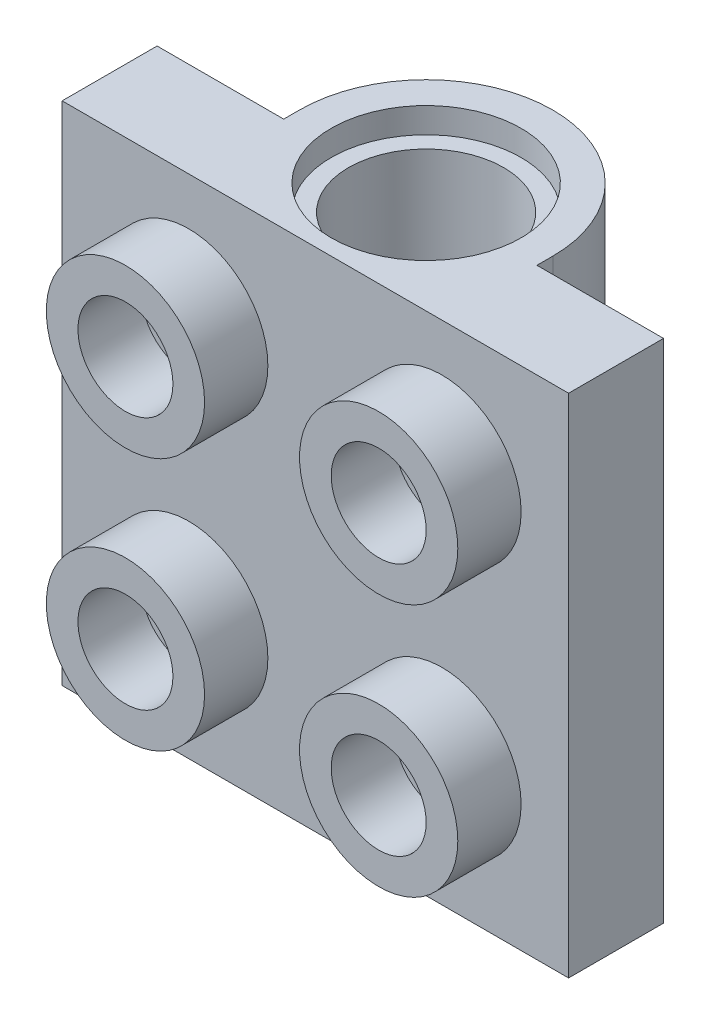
ISO-10303-21;
HEADER;
FILE_DESCRIPTION(('STEP AP214'),'2;1');
FILE_NAME('part.step','',(''),(''),'','','');
FILE_SCHEMA(('AUTOMOTIVE_DESIGN { 1 0 10303 214 1 1 1 1 }'));
ENDSEC;
DATA;
#1=APPLICATION_CONTEXT('core data for automotive mechanical design processes');
#2=APPLICATION_PROTOCOL_DEFINITION('international standard','automotive_design',2000,#1);
#3=PRODUCT_CONTEXT('',#1,'mechanical');
#4=PRODUCT('Part','Part','',(#3));
#5=PRODUCT_RELATED_PRODUCT_CATEGORY('part','',(#4));
#6=PRODUCT_DEFINITION_FORMATION('','',#4);
#7=PRODUCT_DEFINITION_CONTEXT('part definition',#1,'design');
#8=PRODUCT_DEFINITION('design','',#6,#7);
#9=PRODUCT_DEFINITION_SHAPE('','',#8);
#10=(LENGTH_UNIT() NAMED_UNIT(*) SI_UNIT(.MILLI.,.METRE.));
#11=(NAMED_UNIT(*) PLANE_ANGLE_UNIT() SI_UNIT($,.RADIAN.));
#12=(NAMED_UNIT(*) SI_UNIT($,.STERADIAN.) SOLID_ANGLE_UNIT());
#13=UNCERTAINTY_MEASURE_WITH_UNIT(LENGTH_MEASURE(1.E-05),#10,'distance_accuracy_value','');
#14=(GEOMETRIC_REPRESENTATION_CONTEXT(3) GLOBAL_UNCERTAINTY_ASSIGNED_CONTEXT((#13)) GLOBAL_UNIT_ASSIGNED_CONTEXT((#10,
#11,#12)) REPRESENTATION_CONTEXT('',''));
#15=CARTESIAN_POINT('',(0.,0.,0.));
#16=DIRECTION('',(0.,0.,1.));
#17=DIRECTION('',(1.,0.,0.));
#18=AXIS2_PLACEMENT_3D('',#15,#16,#17);
#19=CARTESIAN_POINT('',(-0.577603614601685,7.86828450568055,-3.5));
#20=DIRECTION('',(0.,-1.,0.));
#21=DIRECTION('',(0.,0.,-1.));
#22=AXIS2_PLACEMENT_3D('',#19,#20,#21);
#23=CYLINDRICAL_SURFACE('',#22,2.45);
#24=CARTESIAN_POINT('',(-0.577603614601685,-7.33171549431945,-3.5));
#25=DIRECTION('',(0.,-1.,0.));
#26=DIRECTION('',(0.,0.,-1.));
#27=AXIS2_PLACEMENT_3D('',#24,#25,#26);
#28=CIRCLE('',#27,2.45);
#29=CARTESIAN_POINT('',(-0.577603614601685,-7.33171549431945,-5.95));
#30=VERTEX_POINT('',#29);
#31=EDGE_CURVE('E204',#30,#30,#28,.F.);
#32=ORIENTED_EDGE('',*,*,#31,.F.);
#33=EDGE_LOOP('',(#32));
#34=FACE_BOUND('',#33,.T.);
#35=CARTESIAN_POINT('',(-0.577603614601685,-1.13171549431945,-3.5));
#36=DIRECTION('',(0.,1.,0.));
#37=DIRECTION('',(0.,0.,1.));
#38=AXIS2_PLACEMENT_3D('',#35,#36,#37);
#39=CIRCLE('',#38,2.45);
#40=CARTESIAN_POINT('',(-0.577603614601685,-1.13171549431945,-1.05));
#41=VERTEX_POINT('',#40);
#42=EDGE_CURVE('E235',#41,#41,#39,.F.);
#43=ORIENTED_EDGE('',*,*,#42,.F.);
#44=EDGE_LOOP('',(#43));
#45=FACE_BOUND('',#44,.T.);
#46=ADVANCED_FACE('F35',(#34,#45),#23,.F.);
#47=CARTESIAN_POINT('',(-0.577603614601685,7.06828450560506,-3.5));
#48=DIRECTION('',(0.,1.,0.));
#49=DIRECTION('',(0.,0.,1.));
#50=AXIS2_PLACEMENT_3D('',#47,#48,#49);
#51=CIRCLE('',#50,2.45);
#52=CARTESIAN_POINT('',(-0.577603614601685,7.06828450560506,-1.05));
#53=VERTEX_POINT('',#52);
#54=EDGE_CURVE('E209',#53,#53,#51,.F.);
#55=ORIENTED_EDGE('',*,*,#54,.F.);
#56=EDGE_LOOP('',(#55));
#57=FACE_BOUND('',#56,.T.);
#58=CARTESIAN_POINT('',(-0.577603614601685,0.86828450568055,-3.5));
#59=DIRECTION('',(0.,-1.,0.));
#60=DIRECTION('',(0.,0.,-1.));
#61=AXIS2_PLACEMENT_3D('',#58,#59,#60);
#62=CIRCLE('',#61,2.45);
#63=CARTESIAN_POINT('',(-0.577603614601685,0.86828450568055,-5.95));
#64=VERTEX_POINT('',#63);
#65=EDGE_CURVE('E188',#64,#64,#62,.F.);
#66=ORIENTED_EDGE('',*,*,#65,.F.);
#67=EDGE_LOOP('',(#66));
#68=FACE_BOUND('',#67,.T.);
#69=ADVANCED_FACE('F436',(#57,#68),#23,.F.);
#70=CARTESIAN_POINT('',(-4.57760361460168,7.86828450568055,-3.5));
#71=DIRECTION('',(-1.,0.,0.));
#72=DIRECTION('',(0.,0.,1.));
#73=AXIS2_PLACEMENT_3D('',#70,#71,#72);
#74=PLANE('',#73);
#75=DIRECTION('',(0.,1.,0.));
#76=VECTOR('',#75,1.);
#77=CARTESIAN_POINT('',(-4.57760361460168,6.36828450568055,-1.));
#78=LINE('',#77,#76);
#79=CARTESIAN_POINT('',(-4.57760361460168,-6.63171549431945,-1.));
#80=VERTEX_POINT('',#79);
#81=CARTESIAN_POINT('',(-4.57760361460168,-1.13171549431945,-1.));
#82=VERTEX_POINT('',#81);
#83=EDGE_CURVE('E196',#80,#82,#78,.T.);
#84=ORIENTED_EDGE('',*,*,#83,.T.);
#85=DIRECTION('',(0.,0.,-1.));
#86=VECTOR('',#85,1.);
#87=CARTESIAN_POINT('',(-4.57760361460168,-1.13171549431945,-3.5));
#88=LINE('',#87,#86);
#89=CARTESIAN_POINT('',(-4.57760361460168,-1.13171549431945,-3.5));
#90=VERTEX_POINT('',#89);
#91=EDGE_CURVE('E232',#82,#90,#88,.T.);
#92=ORIENTED_EDGE('',*,*,#91,.T.);
#93=DIRECTION('',(0.,-1.,0.));
#94=VECTOR('',#93,1.);
#95=CARTESIAN_POINT('',(-4.57760361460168,7.86828450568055,-3.5));
#96=LINE('',#95,#94);
#97=CARTESIAN_POINT('',(-4.57760361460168,-8.13171549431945,-3.5));
#98=VERTEX_POINT('',#97);
#99=EDGE_CURVE('E264',#90,#98,#96,.T.);
#100=ORIENTED_EDGE('',*,*,#99,.T.);
#101=DIRECTION('',(0.,0.,-1.));
#102=VECTOR('',#101,1.);
#103=CARTESIAN_POINT('',(-4.57760361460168,-8.13171549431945,-3.5));
#104=LINE('',#103,#102);
#105=CARTESIAN_POINT('',(-4.57760361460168,-8.13171549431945,-3.));
#106=VERTEX_POINT('',#105);
#107=EDGE_CURVE('E250',#106,#98,#104,.T.);
#108=ORIENTED_EDGE('',*,*,#107,.F.);
#109=DIRECTION('',(0.,-1.,0.));
#110=VECTOR('',#109,1.);
#111=CARTESIAN_POINT('',(-4.57760361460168,-8.13171549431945,-3.));
#112=LINE('',#111,#110);
#113=CARTESIAN_POINT('',(-4.57760361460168,-6.63171549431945,-3.));
#114=VERTEX_POINT('',#113);
#115=EDGE_CURVE('E277',#114,#106,#112,.T.);
#116=ORIENTED_EDGE('',*,*,#115,.F.);
#117=DIRECTION('',(0.,0.,-1.));
#118=VECTOR('',#117,1.);
#119=CARTESIAN_POINT('',(-4.57760361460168,-6.63171549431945,-1.));
#120=LINE('',#119,#118);
#121=EDGE_CURVE('E275',#80,#114,#120,.T.);
#122=ORIENTED_EDGE('',*,*,#121,.F.);
#123=EDGE_LOOP('',(#84,#92,#100,#108,#116,#122));
#124=FACE_BOUND('',#123,.T.);
#125=ADVANCED_FACE('F398',(#124),#74,.T.);
#126=CARTESIAN_POINT('',(-4.57760361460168,7.86828450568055,-3.5));
#127=VERTEX_POINT('',#126);
#128=CARTESIAN_POINT('',(-4.57760361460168,0.86828450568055,-3.5));
#129=VERTEX_POINT('',#128);
#130=EDGE_CURVE('E187',#127,#129,#96,.T.);
#131=ORIENTED_EDGE('',*,*,#130,.T.);
#132=DIRECTION('',(0.,0.,1.));
#133=VECTOR('',#132,1.);
#134=CARTESIAN_POINT('',(-4.57760361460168,0.86828450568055,-3.5));
#135=LINE('',#134,#133);
#136=CARTESIAN_POINT('',(-4.57760361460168,0.86828450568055,-1.));
#137=VERTEX_POINT('',#136);
#138=EDGE_CURVE('E50',#129,#137,#135,.T.);
#139=ORIENTED_EDGE('',*,*,#138,.T.);
#140=CARTESIAN_POINT('',(-4.57760361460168,6.36828450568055,-1.));
#141=VERTEX_POINT('',#140);
#142=EDGE_CURVE('E184',#137,#141,#78,.T.);
#143=ORIENTED_EDGE('',*,*,#142,.T.);
#144=DIRECTION('',(0.,0.,1.));
#145=VECTOR('',#144,1.);
#146=CARTESIAN_POINT('',(-4.57760361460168,6.36828450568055,-1.));
#147=LINE('',#146,#145);
#148=CARTESIAN_POINT('',(-4.57760361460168,6.36828450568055,-3.));
#149=VERTEX_POINT('',#148);
#150=EDGE_CURVE('E273',#149,#141,#147,.T.);
#151=ORIENTED_EDGE('',*,*,#150,.F.);
#152=CARTESIAN_POINT('',(-4.57760361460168,7.86828450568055,-3.));
#153=VERTEX_POINT('',#152);
#154=EDGE_CURVE('E279',#153,#149,#112,.T.);
#155=ORIENTED_EDGE('',*,*,#154,.F.);
#156=DIRECTION('',(0.,0.,-1.));
#157=VECTOR('',#156,1.);
#158=CARTESIAN_POINT('',(-4.57760361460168,7.86828450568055,-3.5));
#159=LINE('',#158,#157);
#160=EDGE_CURVE('E252',#153,#127,#159,.T.);
#161=ORIENTED_EDGE('',*,*,#160,.T.);
#162=EDGE_LOOP('',(#131,#139,#143,#151,#155,#161));
#163=FACE_BOUND('',#162,.T.);
#164=ADVANCED_FACE('F182',(#163),#74,.T.);
#165=CARTESIAN_POINT('',(3.42239638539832,7.86828450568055,-3.5));
#166=DIRECTION('',(1.,0.,0.));
#167=DIRECTION('',(0.,0.,-1.));
#168=AXIS2_PLACEMENT_3D('',#165,#166,#167);
#169=PLANE('',#168);
#170=DIRECTION('',(0.,-1.,0.));
#171=VECTOR('',#170,1.);
#172=CARTESIAN_POINT('',(3.42239638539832,7.86828450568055,-3.5));
#173=LINE('',#172,#171);
#174=CARTESIAN_POINT('',(3.42239638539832,-1.13171549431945,-3.5));
#175=VERTEX_POINT('',#174);
#176=CARTESIAN_POINT('',(3.42239638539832,-8.13171549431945,-3.5));
#177=VERTEX_POINT('',#176);
#178=EDGE_CURVE('E254',#175,#177,#173,.T.);
#179=ORIENTED_EDGE('',*,*,#178,.F.);
#180=DIRECTION('',(0.,0.,1.));
#181=VECTOR('',#180,1.);
#182=CARTESIAN_POINT('',(3.42239638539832,-1.13171549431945,-3.5));
#183=LINE('',#182,#181);
#184=CARTESIAN_POINT('',(3.42239638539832,-1.13171549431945,-1.));
#185=VERTEX_POINT('',#184);
#186=EDGE_CURVE('E229',#175,#185,#183,.T.);
#187=ORIENTED_EDGE('',*,*,#186,.T.);
#188=DIRECTION('',(0.,-1.,0.));
#189=VECTOR('',#188,1.);
#190=CARTESIAN_POINT('',(3.42239638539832,6.36828450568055,-1.));
#191=LINE('',#190,#189);
#192=CARTESIAN_POINT('',(3.42239638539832,-6.63171549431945,-1.));
#193=VERTEX_POINT('',#192);
#194=EDGE_CURVE('E200',#185,#193,#191,.T.);
#195=ORIENTED_EDGE('',*,*,#194,.T.);
#196=DIRECTION('',(0.,0.,1.));
#197=VECTOR('',#196,1.);
#198=CARTESIAN_POINT('',(3.42239638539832,-6.63171549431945,-1.));
#199=LINE('',#198,#197);
#200=CARTESIAN_POINT('',(3.42239638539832,-6.63171549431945,-3.));
#201=VERTEX_POINT('',#200);
#202=EDGE_CURVE('E267',#201,#193,#199,.T.);
#203=ORIENTED_EDGE('',*,*,#202,.F.);
#204=DIRECTION('',(0.,1.,0.));
#205=VECTOR('',#204,1.);
#206=CARTESIAN_POINT('',(3.42239638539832,-8.13171549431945,-3.));
#207=LINE('',#206,#205);
#208=CARTESIAN_POINT('',(3.42239638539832,-8.13171549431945,-3.));
#209=VERTEX_POINT('',#208);
#210=EDGE_CURVE('E272',#209,#201,#207,.T.);
#211=ORIENTED_EDGE('',*,*,#210,.F.);
#212=DIRECTION('',(0.,0.,1.));
#213=VECTOR('',#212,1.);
#214=CARTESIAN_POINT('',(3.42239638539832,-8.13171549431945,-3.5));
#215=LINE('',#214,#213);
#216=EDGE_CURVE('E257',#177,#209,#215,.T.);
#217=ORIENTED_EDGE('',*,*,#216,.F.);
#218=EDGE_LOOP('',(#179,#187,#195,#203,#211,#217));
#219=FACE_BOUND('',#218,.T.);
#220=ADVANCED_FACE('F376',(#219),#169,.T.);
#221=CARTESIAN_POINT('',(3.42239638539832,6.36828450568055,-1.));
#222=VERTEX_POINT('',#221);
#223=CARTESIAN_POINT('',(3.42239638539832,0.86828450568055,-1.));
#224=VERTEX_POINT('',#223);
#225=EDGE_CURVE('E197',#222,#224,#191,.T.);
#226=ORIENTED_EDGE('',*,*,#225,.T.);
#227=DIRECTION('',(0.,0.,-1.));
#228=VECTOR('',#227,1.);
#229=CARTESIAN_POINT('',(3.42239638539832,0.86828450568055,-3.5));
#230=LINE('',#229,#228);
#231=CARTESIAN_POINT('',(3.42239638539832,0.86828450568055,-3.5));
#232=VERTEX_POINT('',#231);
#233=EDGE_CURVE('E174',#224,#232,#230,.T.);
#234=ORIENTED_EDGE('',*,*,#233,.T.);
#235=CARTESIAN_POINT('',(3.42239638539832,7.86828450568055,-3.5));
#236=VERTEX_POINT('',#235);
#237=EDGE_CURVE('E218',#236,#232,#173,.T.);
#238=ORIENTED_EDGE('',*,*,#237,.F.);
#239=DIRECTION('',(0.,0.,1.));
#240=VECTOR('',#239,1.);
#241=CARTESIAN_POINT('',(3.42239638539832,7.86828450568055,-3.5));
#242=LINE('',#241,#240);
#243=CARTESIAN_POINT('',(3.42239638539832,7.86828450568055,-3.));
#244=VERTEX_POINT('',#243);
#245=EDGE_CURVE('E249',#236,#244,#242,.T.);
#246=ORIENTED_EDGE('',*,*,#245,.T.);
#247=CARTESIAN_POINT('',(3.42239638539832,6.36828450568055,-3.));
#248=VERTEX_POINT('',#247);
#249=EDGE_CURVE('E270',#248,#244,#207,.T.);
#250=ORIENTED_EDGE('',*,*,#249,.F.);
#251=DIRECTION('',(0.,0.,-1.));
#252=VECTOR('',#251,1.);
#253=CARTESIAN_POINT('',(3.42239638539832,6.36828450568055,-1.));
#254=LINE('',#253,#252);
#255=EDGE_CURVE('E263',#222,#248,#254,.T.);
#256=ORIENTED_EDGE('',*,*,#255,.F.);
#257=EDGE_LOOP('',(#226,#234,#238,#246,#250,#256));
#258=FACE_BOUND('',#257,.T.);
#259=ADVANCED_FACE('F220',(#258),#169,.T.);
#260=CARTESIAN_POINT('',(-0.577603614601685,7.86828450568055,-3.5));
#261=DIRECTION('',(0.,-1.,0.));
#262=DIRECTION('',(0.,0.,-1.));
#263=AXIS2_PLACEMENT_3D('',#260,#261,#262);
#264=CYLINDRICAL_SURFACE('',#263,4.);
#265=ORIENTED_EDGE('',*,*,#99,.F.);
#266=CARTESIAN_POINT('',(-0.577603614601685,-1.13171549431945,-3.5));
#267=DIRECTION('',(0.,1.,0.));
#268=DIRECTION('',(0.,0.,1.));
#269=AXIS2_PLACEMENT_3D('',#266,#267,#268);
#270=CIRCLE('',#269,4.);
#271=EDGE_CURVE('E11',#90,#175,#270,.F.);
#272=ORIENTED_EDGE('',*,*,#271,.T.);
#273=ORIENTED_EDGE('',*,*,#178,.T.);
#274=CARTESIAN_POINT('',(-0.577603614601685,-8.13171549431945,-3.5));
#275=DIRECTION('',(0.,-1.,0.));
#276=DIRECTION('',(0.,0.,-1.));
#277=AXIS2_PLACEMENT_3D('',#274,#275,#276);
#278=CIRCLE('',#277,4.);
#279=EDGE_CURVE('E207',#98,#177,#278,.T.);
#280=ORIENTED_EDGE('',*,*,#279,.F.);
#281=EDGE_LOOP('',(#265,#272,#273,#280));
#282=FACE_BOUND('',#281,.T.);
#283=ADVANCED_FACE('F393',(#282),#264,.T.);
#284=ORIENTED_EDGE('',*,*,#237,.T.);
#285=CARTESIAN_POINT('',(-0.577603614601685,0.86828450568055,-3.5));
#286=DIRECTION('',(0.,-1.,0.));
#287=DIRECTION('',(0.,0.,-1.));
#288=AXIS2_PLACEMENT_3D('',#285,#286,#287);
#289=CIRCLE('',#288,4.);
#290=EDGE_CURVE('E43',#232,#129,#289,.F.);
#291=ORIENTED_EDGE('',*,*,#290,.T.);
#292=ORIENTED_EDGE('',*,*,#130,.F.);
#293=CARTESIAN_POINT('',(-0.577603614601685,7.86828450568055,-3.5));
#294=DIRECTION('',(0.,-1.,0.));
#295=DIRECTION('',(0.,0.,-1.));
#296=AXIS2_PLACEMENT_3D('',#293,#294,#295);
#297=CIRCLE('',#296,4.);
#298=EDGE_CURVE('E247',#127,#236,#297,.T.);
#299=ORIENTED_EDGE('',*,*,#298,.T.);
#300=EDGE_LOOP('',(#284,#291,#292,#299));
#301=FACE_BOUND('',#300,.T.);
#302=ADVANCED_FACE('F215',(#301),#264,.T.);
#303=CARTESIAN_POINT('',(-8.57760361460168,-8.13171549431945,-3.));
#304=DIRECTION('',(0.,0.,1.));
#305=DIRECTION('',(1.,0.,0.));
#306=AXIS2_PLACEMENT_3D('',#303,#304,#305);
#307=PLANE('',#306);
#308=DIRECTION('',(-1.,0.,0.));
#309=VECTOR('',#308,1.);
#310=CARTESIAN_POINT('',(-8.57760361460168,7.86828450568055,-3.));
#311=LINE('',#310,#309);
#312=CARTESIAN_POINT('',(-8.57760361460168,7.86828450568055,-3.));
#313=VERTEX_POINT('',#312);
#314=EDGE_CURVE('E338',#153,#313,#311,.T.);
#315=ORIENTED_EDGE('',*,*,#314,.F.);
#316=ORIENTED_EDGE('',*,*,#154,.T.);
#317=DIRECTION('',(1.,0.,0.));
#318=VECTOR('',#317,1.);
#319=CARTESIAN_POINT('',(-7.07760361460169,6.36828450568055,-3.));
#320=LINE('',#319,#318);
#321=CARTESIAN_POINT('',(-7.07760361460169,6.36828450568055,-3.));
#322=VERTEX_POINT('',#321);
#323=EDGE_CURVE('E296',#322,#149,#320,.T.);
#324=ORIENTED_EDGE('',*,*,#323,.F.);
#325=DIRECTION('',(0.,1.,0.));
#326=VECTOR('',#325,1.);
#327=CARTESIAN_POINT('',(-7.07760361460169,-6.63171549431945,-3.));
#328=LINE('',#327,#326);
#329=CARTESIAN_POINT('',(-7.07760361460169,-6.63171549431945,-3.));
#330=VERTEX_POINT('',#329);
#331=EDGE_CURVE('E293',#330,#322,#328,.T.);
#332=ORIENTED_EDGE('',*,*,#331,.F.);
#333=DIRECTION('',(-1.,0.,0.));
#334=VECTOR('',#333,1.);
#335=CARTESIAN_POINT('',(-7.07760361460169,-6.63171549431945,-3.));
#336=LINE('',#335,#334);
#337=EDGE_CURVE('E302',#114,#330,#336,.T.);
#338=ORIENTED_EDGE('',*,*,#337,.F.);
#339=ORIENTED_EDGE('',*,*,#115,.T.);
#340=DIRECTION('',(1.,0.,0.));
#341=VECTOR('',#340,1.);
#342=CARTESIAN_POINT('',(-8.57760361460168,-8.13171549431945,-3.));
#343=LINE('',#342,#341);
#344=CARTESIAN_POINT('',(-8.57760361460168,-8.13171549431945,-3.));
#345=VERTEX_POINT('',#344);
#346=EDGE_CURVE('E332',#345,#106,#343,.T.);
#347=ORIENTED_EDGE('',*,*,#346,.F.);
#348=DIRECTION('',(0.,-1.,0.));
#349=VECTOR('',#348,1.);
#350=CARTESIAN_POINT('',(-8.57760361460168,7.86828450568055,-3.));
#351=LINE('',#350,#349);
#352=EDGE_CURVE('E328',#313,#345,#351,.T.);
#353=ORIENTED_EDGE('',*,*,#352,.F.);
#354=EDGE_LOOP('',(#315,#316,#324,#332,#338,#339,#347,#353));
#355=FACE_BOUND('',#354,.T.);
#356=ADVANCED_FACE('F573',(#355),#307,.F.);
#357=CARTESIAN_POINT('',(-7.07760361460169,-6.63171549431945,-1.));
#358=DIRECTION('',(0.,-1.,0.));
#359=DIRECTION('',(1.,0.,0.));
#360=AXIS2_PLACEMENT_3D('',#357,#358,#359);
#361=PLANE('',#360);
#362=DIRECTION('',(-1.,0.,0.));
#363=VECTOR('',#362,1.);
#364=CARTESIAN_POINT('',(-7.07760361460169,-6.63171549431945,-1.));
#365=LINE('',#364,#363);
#366=CARTESIAN_POINT('',(-7.07760361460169,-6.63171549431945,-1.));
#367=VERTEX_POINT('',#366);
#368=EDGE_CURVE('E288',#80,#367,#365,.T.);
#369=ORIENTED_EDGE('',*,*,#368,.F.);
#370=ORIENTED_EDGE('',*,*,#121,.T.);
#371=ORIENTED_EDGE('',*,*,#337,.T.);
#372=DIRECTION('',(0.,0.,-1.));
#373=VECTOR('',#372,1.);
#374=CARTESIAN_POINT('',(-7.07760361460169,-6.63171549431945,-1.));
#375=LINE('',#374,#373);
#376=EDGE_CURVE('E305',#367,#330,#375,.T.);
#377=ORIENTED_EDGE('',*,*,#376,.F.);
#378=EDGE_LOOP('',(#369,#370,#371,#377));
#379=FACE_BOUND('',#378,.T.);
#380=ADVANCED_FACE('F404',(#379),#361,.F.);
#381=CARTESIAN_POINT('',(-7.07760361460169,6.36828450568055,-1.));
#382=DIRECTION('',(0.,1.,0.));
#383=DIRECTION('',(-1.,0.,0.));
#384=AXIS2_PLACEMENT_3D('',#381,#382,#383);
#385=PLANE('',#384);
#386=ORIENTED_EDGE('',*,*,#323,.T.);
#387=ORIENTED_EDGE('',*,*,#150,.T.);
#388=DIRECTION('',(1.,0.,0.));
#389=VECTOR('',#388,1.);
#390=CARTESIAN_POINT('',(-7.07760361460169,6.36828450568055,-1.));
#391=LINE('',#390,#389);
#392=CARTESIAN_POINT('',(-7.07760361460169,6.36828450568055,-1.));
#393=VERTEX_POINT('',#392);
#394=EDGE_CURVE('E195',#393,#141,#391,.T.);
#395=ORIENTED_EDGE('',*,*,#394,.F.);
#396=DIRECTION('',(0.,0.,-1.));
#397=VECTOR('',#396,1.);
#398=CARTESIAN_POINT('',(-7.07760361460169,6.36828450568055,-1.));
#399=LINE('',#398,#397);
#400=EDGE_CURVE('E292',#393,#322,#399,.T.);
#401=ORIENTED_EDGE('',*,*,#400,.T.);
#402=EDGE_LOOP('',(#386,#387,#395,#401));
#403=FACE_BOUND('',#402,.T.);
#404=ADVANCED_FACE('F412',(#403),#385,.F.);
#405=CARTESIAN_POINT('',(-8.57760361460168,-8.13171549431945,0.));
#406=DIRECTION('',(0.,0.,1.));
#407=DIRECTION('',(1.,0.,0.));
#408=AXIS2_PLACEMENT_3D('',#405,#406,#407);
#409=PLANE('',#408);
#410=CARTESIAN_POINT('',(-4.57760361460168,3.86828450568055,0.));
#411=DIRECTION('',(0.,0.,1.));
#412=DIRECTION('',(1.,0.,0.));
#413=AXIS2_PLACEMENT_3D('',#410,#411,#412);
#414=CIRCLE('',#413,2.5);
#415=CARTESIAN_POINT('',(-2.07760361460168,3.86828450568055,0.));
#416=VERTEX_POINT('',#415);
#417=EDGE_CURVE('E354',#416,#416,#414,.T.);
#418=ORIENTED_EDGE('',*,*,#417,.F.);
#419=EDGE_LOOP('',(#418));
#420=FACE_BOUND('',#419,.T.);
#421=CARTESIAN_POINT('',(-4.57760361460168,-4.13171549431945,0.));
#422=DIRECTION('',(0.,0.,1.));
#423=DIRECTION('',(1.,0.,0.));
#424=AXIS2_PLACEMENT_3D('',#421,#422,#423);
#425=CIRCLE('',#424,2.5);
#426=CARTESIAN_POINT('',(-2.07760361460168,-4.13171549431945,0.));
#427=VERTEX_POINT('',#426);
#428=EDGE_CURVE('E321',#427,#427,#425,.T.);
#429=ORIENTED_EDGE('',*,*,#428,.F.);
#430=EDGE_LOOP('',(#429));
#431=FACE_BOUND('',#430,.T.);
#432=CARTESIAN_POINT('',(3.42239638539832,-4.13171549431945,0.));
#433=DIRECTION('',(0.,0.,1.));
#434=DIRECTION('',(1.,0.,0.));
#435=AXIS2_PLACEMENT_3D('',#432,#433,#434);
#436=CIRCLE('',#435,2.5);
#437=CARTESIAN_POINT('',(5.92239638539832,-4.13171549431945,0.));
#438=VERTEX_POINT('',#437);
#439=EDGE_CURVE('E308',#438,#438,#436,.T.);
#440=ORIENTED_EDGE('',*,*,#439,.F.);
#441=EDGE_LOOP('',(#440));
#442=FACE_BOUND('',#441,.T.);
#443=CARTESIAN_POINT('',(3.42239638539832,3.86828450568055,0.));
#444=DIRECTION('',(0.,0.,1.));
#445=DIRECTION('',(1.,0.,0.));
#446=AXIS2_PLACEMENT_3D('',#443,#444,#445);
#447=CIRCLE('',#446,2.5);
#448=CARTESIAN_POINT('',(5.92239638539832,3.86828450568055,0.));
#449=VERTEX_POINT('',#448);
#450=EDGE_CURVE('E366',#449,#449,#447,.T.);
#451=ORIENTED_EDGE('',*,*,#450,.F.);
#452=EDGE_LOOP('',(#451));
#453=FACE_BOUND('',#452,.T.);
#454=DIRECTION('',(1.,0.,0.));
#455=VECTOR('',#454,1.);
#456=CARTESIAN_POINT('',(-8.57760361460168,-8.13171549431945,0.));
#457=LINE('',#456,#455);
#458=CARTESIAN_POINT('',(-8.57760361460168,-8.13171549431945,0.));
#459=VERTEX_POINT('',#458);
#460=CARTESIAN_POINT('',(7.42239638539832,-8.13171549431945,0.));
#461=VERTEX_POINT('',#460);
#462=EDGE_CURVE('E345',#459,#461,#457,.T.);
#463=ORIENTED_EDGE('',*,*,#462,.T.);
#464=DIRECTION('',(0.,1.,0.));
#465=VECTOR('',#464,1.);
#466=CARTESIAN_POINT('',(7.42239638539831,7.86828450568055,0.));
#467=LINE('',#466,#465);
#468=CARTESIAN_POINT('',(7.42239638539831,7.86828450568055,0.));
#469=VERTEX_POINT('',#468);
#470=EDGE_CURVE('E347',#461,#469,#467,.T.);
#471=ORIENTED_EDGE('',*,*,#470,.T.);
#472=DIRECTION('',(-1.,0.,0.));
#473=VECTOR('',#472,1.);
#474=CARTESIAN_POINT('',(-8.57760361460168,7.86828450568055,0.));
#475=LINE('',#474,#473);
#476=CARTESIAN_POINT('',(-8.57760361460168,7.86828450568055,0.));
#477=VERTEX_POINT('',#476);
#478=EDGE_CURVE('E331',#469,#477,#475,.T.);
#479=ORIENTED_EDGE('',*,*,#478,.T.);
#480=DIRECTION('',(0.,-1.,0.));
#481=VECTOR('',#480,1.);
#482=CARTESIAN_POINT('',(-8.57760361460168,7.86828450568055,0.));
#483=LINE('',#482,#481);
#484=EDGE_CURVE('E325',#477,#459,#483,.T.);
#485=ORIENTED_EDGE('',*,*,#484,.T.);
#486=EDGE_LOOP('',(#463,#471,#479,#485));
#487=FACE_BOUND('',#486,.T.);
#488=ADVANCED_FACE('F554',(#420,#431,#442,#453,#487),#409,.T.);
#489=CARTESIAN_POINT('',(-8.57760361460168,7.86828450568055,-3.));
#490=DIRECTION('',(-1.,0.,0.));
#491=DIRECTION('',(0.,0.,1.));
#492=AXIS2_PLACEMENT_3D('',#489,#490,#491);
#493=PLANE('',#492);
#494=ORIENTED_EDGE('',*,*,#484,.F.);
#495=DIRECTION('',(0.,0.,1.));
#496=VECTOR('',#495,1.);
#497=CARTESIAN_POINT('',(-8.57760361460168,7.86828450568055,-3.));
#498=LINE('',#497,#496);
#499=EDGE_CURVE('E351',#313,#477,#498,.T.);
#500=ORIENTED_EDGE('',*,*,#499,.F.);
#501=ORIENTED_EDGE('',*,*,#352,.T.);
#502=DIRECTION('',(0.,0.,1.));
#503=VECTOR('',#502,1.);
#504=CARTESIAN_POINT('',(-8.57760361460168,-8.13171549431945,-3.));
#505=LINE('',#504,#503);
#506=EDGE_CURVE('E342',#345,#459,#505,.T.);
#507=ORIENTED_EDGE('',*,*,#506,.T.);
#508=EDGE_LOOP('',(#494,#500,#501,#507));
#509=FACE_BOUND('',#508,.T.);
#510=ADVANCED_FACE('F557',(#509),#493,.T.);
#511=CARTESIAN_POINT('',(-8.57760361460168,7.86828450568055,-3.));
#512=DIRECTION('',(0.,1.,0.));
#513=DIRECTION('',(0.,0.,1.));
#514=AXIS2_PLACEMENT_3D('',#511,#512,#513);
#515=PLANE('',#514);
#516=CARTESIAN_POINT('',(-0.577603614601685,7.86828450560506,-3.5));
#517=DIRECTION('',(0.,1.,0.));
#518=DIRECTION('',(0.,0.,1.));
#519=AXIS2_PLACEMENT_3D('',#516,#517,#518);
#520=CIRCLE('',#519,3.);
#521=CARTESIAN_POINT('',(-0.577603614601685,7.86828450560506,-0.499999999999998));
#522=VERTEX_POINT('',#521);
#523=EDGE_CURVE('E238',#522,#522,#520,.T.);
#524=ORIENTED_EDGE('',*,*,#523,.F.);
#525=EDGE_LOOP('',(#524));
#526=FACE_BOUND('',#525,.T.);
#527=CARTESIAN_POINT('',(7.42239638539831,7.86828450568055,-3.));
#528=VERTEX_POINT('',#527);
#529=EDGE_CURVE('E339',#528,#244,#311,.T.);
#530=ORIENTED_EDGE('',*,*,#529,.T.);
#531=ORIENTED_EDGE('',*,*,#245,.F.);
#532=ORIENTED_EDGE('',*,*,#298,.F.);
#533=ORIENTED_EDGE('',*,*,#160,.F.);
#534=ORIENTED_EDGE('',*,*,#314,.T.);
#535=ORIENTED_EDGE('',*,*,#499,.T.);
#536=ORIENTED_EDGE('',*,*,#478,.F.);
#537=DIRECTION('',(0.,0.,1.));
#538=VECTOR('',#537,1.);
#539=CARTESIAN_POINT('',(7.42239638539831,7.86828450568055,-3.));
#540=LINE('',#539,#538);
#541=EDGE_CURVE('E355',#528,#469,#540,.T.);
#542=ORIENTED_EDGE('',*,*,#541,.F.);
#543=EDGE_LOOP('',(#530,#531,#532,#533,#534,#535,#536,#542));
#544=FACE_BOUND('',#543,.T.);
#545=ADVANCED_FACE('F417',(#526,#544),#515,.T.);
#546=CARTESIAN_POINT('',(7.42239638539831,7.86828450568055,-3.));
#547=DIRECTION('',(1.,0.,0.));
#548=DIRECTION('',(0.,1.,0.));
#549=AXIS2_PLACEMENT_3D('',#546,#547,#548);
#550=PLANE('',#549);
#551=ORIENTED_EDGE('',*,*,#470,.F.);
#552=DIRECTION('',(0.,0.,1.));
#553=VECTOR('',#552,1.);
#554=CARTESIAN_POINT('',(7.42239638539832,-8.13171549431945,-3.));
#555=LINE('',#554,#553);
#556=CARTESIAN_POINT('',(7.42239638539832,-8.13171549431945,-3.));
#557=VERTEX_POINT('',#556);
#558=EDGE_CURVE('E357',#557,#461,#555,.T.);
#559=ORIENTED_EDGE('',*,*,#558,.F.);
#560=DIRECTION('',(0.,1.,0.));
#561=VECTOR('',#560,1.);
#562=CARTESIAN_POINT('',(7.42239638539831,7.86828450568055,-3.));
#563=LINE('',#562,#561);
#564=EDGE_CURVE('E335',#557,#528,#563,.T.);
#565=ORIENTED_EDGE('',*,*,#564,.T.);
#566=ORIENTED_EDGE('',*,*,#541,.T.);
#567=EDGE_LOOP('',(#551,#559,#565,#566));
#568=FACE_BOUND('',#567,.T.);
#569=ADVANCED_FACE('F569',(#568),#550,.T.);
#570=CARTESIAN_POINT('',(-8.57760361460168,-8.13171549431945,-3.));
#571=DIRECTION('',(0.,-1.,0.));
#572=DIRECTION('',(0.,0.,-1.));
#573=AXIS2_PLACEMENT_3D('',#570,#571,#572);
#574=PLANE('',#573);
#575=CARTESIAN_POINT('',(-0.577603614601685,-8.13171549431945,-3.5));
#576=DIRECTION('',(0.,-1.,0.));
#577=DIRECTION('',(0.,0.,-1.));
#578=AXIS2_PLACEMENT_3D('',#575,#576,#577);
#579=CIRCLE('',#578,3.);
#580=CARTESIAN_POINT('',(-0.577603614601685,-8.13171549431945,-6.5));
#581=VERTEX_POINT('',#580);
#582=EDGE_CURVE('E211',#581,#581,#579,.T.);
#583=ORIENTED_EDGE('',*,*,#582,.F.);
#584=EDGE_LOOP('',(#583));
#585=FACE_BOUND('',#584,.T.);
#586=ORIENTED_EDGE('',*,*,#558,.T.);
#587=ORIENTED_EDGE('',*,*,#462,.F.);
#588=ORIENTED_EDGE('',*,*,#506,.F.);
#589=ORIENTED_EDGE('',*,*,#346,.T.);
#590=ORIENTED_EDGE('',*,*,#107,.T.);
#591=ORIENTED_EDGE('',*,*,#279,.T.);
#592=ORIENTED_EDGE('',*,*,#216,.T.);
#593=EDGE_CURVE('E58',#209,#557,#343,.T.);
#594=ORIENTED_EDGE('',*,*,#593,.T.);
#595=EDGE_LOOP('',(#586,#587,#588,#589,#590,#591,#592,#594));
#596=FACE_BOUND('',#595,.T.);
#597=ADVANCED_FACE('F387',(#585,#596),#574,.T.);
#598=ORIENTED_EDGE('',*,*,#593,.F.);
#599=ORIENTED_EDGE('',*,*,#210,.T.);
#600=CARTESIAN_POINT('',(5.92239638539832,-6.63171549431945,-3.));
#601=VERTEX_POINT('',#600);
#602=EDGE_CURVE('E283',#601,#201,#336,.T.);
#603=ORIENTED_EDGE('',*,*,#602,.F.);
#604=DIRECTION('',(0.,-1.,0.));
#605=VECTOR('',#604,1.);
#606=CARTESIAN_POINT('',(5.92239638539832,-6.63171549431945,-3.));
#607=LINE('',#606,#605);
#608=CARTESIAN_POINT('',(5.92239638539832,6.36828450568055,-3.));
#609=VERTEX_POINT('',#608);
#610=EDGE_CURVE('E299',#609,#601,#607,.T.);
#611=ORIENTED_EDGE('',*,*,#610,.F.);
#612=EDGE_CURVE('E295',#248,#609,#320,.T.);
#613=ORIENTED_EDGE('',*,*,#612,.F.);
#614=ORIENTED_EDGE('',*,*,#249,.T.);
#615=ORIENTED_EDGE('',*,*,#529,.F.);
#616=ORIENTED_EDGE('',*,*,#564,.F.);
#617=EDGE_LOOP('',(#598,#599,#603,#611,#613,#614,#615,#616));
#618=FACE_BOUND('',#617,.T.);
#619=ADVANCED_FACE('F383',(#618),#307,.F.);
#620=CARTESIAN_POINT('',(-4.57760361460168,-4.13171549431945,2.));
#621=DIRECTION('',(0.,0.,-1.));
#622=DIRECTION('',(-1.,0.,0.));
#623=AXIS2_PLACEMENT_3D('',#620,#621,#622);
#624=CYLINDRICAL_SURFACE('',#623,2.5);
#625=CARTESIAN_POINT('',(-4.57760361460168,-4.13171549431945,2.));
#626=DIRECTION('',(0.,0.,1.));
#627=DIRECTION('',(1.,0.,0.));
#628=AXIS2_PLACEMENT_3D('',#625,#626,#627);
#629=CIRCLE('',#628,2.5);
#630=CARTESIAN_POINT('',(-2.07760361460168,-4.13171549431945,2.));
#631=VERTEX_POINT('',#630);
#632=EDGE_CURVE('E322',#631,#631,#629,.T.);
#633=ORIENTED_EDGE('',*,*,#632,.F.);
#634=EDGE_LOOP('',(#633));
#635=FACE_BOUND('',#634,.T.);
#636=ORIENTED_EDGE('',*,*,#428,.T.);
#637=EDGE_LOOP('',(#636));
#638=FACE_BOUND('',#637,.T.);
#639=ADVANCED_FACE('F544',(#635,#638),#624,.T.);
#640=CARTESIAN_POINT('',(-4.57760361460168,-4.13171549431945,2.));
#641=DIRECTION('',(0.,0.,1.));
#642=DIRECTION('',(1.,0.,0.));
#643=AXIS2_PLACEMENT_3D('',#640,#641,#642);
#644=PLANE('',#643);
#645=CARTESIAN_POINT('',(-4.57760361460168,-4.13171549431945,2.));
#646=DIRECTION('',(0.,0.,1.));
#647=DIRECTION('',(1.,0.,0.));
#648=AXIS2_PLACEMENT_3D('',#645,#646,#647);
#649=CIRCLE('',#648,1.5);
#650=CARTESIAN_POINT('',(-3.07760361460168,-4.13171549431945,2.));
#651=VERTEX_POINT('',#650);
#652=EDGE_CURVE('E530',#651,#651,#649,.T.);
#653=ORIENTED_EDGE('',*,*,#652,.F.);
#654=EDGE_LOOP('',(#653));
#655=FACE_BOUND('',#654,.T.);
#656=ORIENTED_EDGE('',*,*,#632,.T.);
#657=EDGE_LOOP('',(#656));
#658=FACE_BOUND('',#657,.T.);
#659=ADVANCED_FACE('F540',(#655,#658),#644,.T.);
#660=CARTESIAN_POINT('',(3.42239638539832,-4.13171549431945,2.));
#661=DIRECTION('',(0.,0.,-1.));
#662=DIRECTION('',(-1.,0.,0.));
#663=AXIS2_PLACEMENT_3D('',#660,#661,#662);
#664=CYLINDRICAL_SURFACE('',#663,2.5);
#665=CARTESIAN_POINT('',(3.42239638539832,-4.13171549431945,2.));
#666=DIRECTION('',(0.,0.,1.));
#667=DIRECTION('',(1.,0.,0.));
#668=AXIS2_PLACEMENT_3D('',#665,#666,#667);
#669=CIRCLE('',#668,2.5);
#670=CARTESIAN_POINT('',(5.92239638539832,-4.13171549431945,2.));
#671=VERTEX_POINT('',#670);
#672=EDGE_CURVE('E318',#671,#671,#669,.T.);
#673=ORIENTED_EDGE('',*,*,#672,.F.);
#674=EDGE_LOOP('',(#673));
#675=FACE_BOUND('',#674,.T.);
#676=ORIENTED_EDGE('',*,*,#439,.T.);
#677=EDGE_LOOP('',(#676));
#678=FACE_BOUND('',#677,.T.);
#679=ADVANCED_FACE('F543',(#675,#678),#664,.T.);
#680=CARTESIAN_POINT('',(3.42239638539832,-4.13171549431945,2.));
#681=DIRECTION('',(0.,0.,1.));
#682=DIRECTION('',(1.,0.,0.));
#683=AXIS2_PLACEMENT_3D('',#680,#681,#682);
#684=PLANE('',#683);
#685=CARTESIAN_POINT('',(3.42239638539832,-4.13171549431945,2.));
#686=DIRECTION('',(0.,0.,1.));
#687=DIRECTION('',(1.,0.,0.));
#688=AXIS2_PLACEMENT_3D('',#685,#686,#687);
#689=CIRCLE('',#688,1.5);
#690=CARTESIAN_POINT('',(4.92239638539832,-4.13171549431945,2.));
#691=VERTEX_POINT('',#690);
#692=EDGE_CURVE('E525',#691,#691,#689,.T.);
#693=ORIENTED_EDGE('',*,*,#692,.F.);
#694=EDGE_LOOP('',(#693));
#695=FACE_BOUND('',#694,.T.);
#696=ORIENTED_EDGE('',*,*,#672,.T.);
#697=EDGE_LOOP('',(#696));
#698=FACE_BOUND('',#697,.T.);
#699=ADVANCED_FACE('F546',(#695,#698),#684,.T.);
#700=CARTESIAN_POINT('',(-4.57760361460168,3.86828450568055,2.));
#701=DIRECTION('',(0.,0.,1.));
#702=DIRECTION('',(1.,0.,0.));
#703=AXIS2_PLACEMENT_3D('',#700,#701,#702);
#704=PLANE('',#703);
#705=CARTESIAN_POINT('',(-4.57760361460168,3.86828450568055,2.));
#706=DIRECTION('',(0.,0.,1.));
#707=DIRECTION('',(1.,0.,0.));
#708=AXIS2_PLACEMENT_3D('',#705,#706,#707);
#709=CIRCLE('',#708,1.5);
#710=CARTESIAN_POINT('',(-3.07760361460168,3.86828450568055,2.));
#711=VERTEX_POINT('',#710);
#712=EDGE_CURVE('E515',#711,#711,#709,.T.);
#713=ORIENTED_EDGE('',*,*,#712,.F.);
#714=EDGE_LOOP('',(#713));
#715=FACE_BOUND('',#714,.T.);
#716=CARTESIAN_POINT('',(-4.57760361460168,3.86828450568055,2.));
#717=DIRECTION('',(0.,0.,1.));
#718=DIRECTION('',(1.,0.,0.));
#719=AXIS2_PLACEMENT_3D('',#716,#717,#718);
#720=CIRCLE('',#719,2.5);
#721=CARTESIAN_POINT('',(-2.07760361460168,3.86828450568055,2.));
#722=VERTEX_POINT('',#721);
#723=EDGE_CURVE('E363',#722,#722,#720,.T.);
#724=ORIENTED_EDGE('',*,*,#723,.T.);
#725=EDGE_LOOP('',(#724));
#726=FACE_BOUND('',#725,.T.);
#727=ADVANCED_FACE('F598',(#715,#726),#704,.T.);
#728=CARTESIAN_POINT('',(-4.57760361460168,3.86828450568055,2.));
#729=DIRECTION('',(0.,0.,-1.));
#730=DIRECTION('',(-1.,0.,0.));
#731=AXIS2_PLACEMENT_3D('',#728,#729,#730);
#732=CYLINDRICAL_SURFACE('',#731,2.5);
#733=ORIENTED_EDGE('',*,*,#723,.F.);
#734=EDGE_LOOP('',(#733));
#735=FACE_BOUND('',#734,.T.);
#736=ORIENTED_EDGE('',*,*,#417,.T.);
#737=EDGE_LOOP('',(#736));
#738=FACE_BOUND('',#737,.T.);
#739=ADVANCED_FACE('F595',(#735,#738),#732,.T.);
#740=CARTESIAN_POINT('',(3.42239638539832,3.86828450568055,2.));
#741=DIRECTION('',(0.,0.,1.));
#742=DIRECTION('',(1.,0.,0.));
#743=AXIS2_PLACEMENT_3D('',#740,#741,#742);
#744=PLANE('',#743);
#745=CARTESIAN_POINT('',(3.42239638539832,3.86828450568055,2.));
#746=DIRECTION('',(0.,0.,1.));
#747=DIRECTION('',(1.,0.,0.));
#748=AXIS2_PLACEMENT_3D('',#745,#746,#747);
#749=CIRCLE('',#748,1.5);
#750=CARTESIAN_POINT('',(4.92239638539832,3.86828450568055,2.));
#751=VERTEX_POINT('',#750);
#752=EDGE_CURVE('E516',#751,#751,#749,.T.);
#753=ORIENTED_EDGE('',*,*,#752,.F.);
#754=EDGE_LOOP('',(#753));
#755=FACE_BOUND('',#754,.T.);
#756=CARTESIAN_POINT('',(3.42239638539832,3.86828450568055,2.));
#757=DIRECTION('',(0.,0.,1.));
#758=DIRECTION('',(1.,0.,0.));
#759=AXIS2_PLACEMENT_3D('',#756,#757,#758);
#760=CIRCLE('',#759,2.5);
#761=CARTESIAN_POINT('',(5.92239638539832,3.86828450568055,2.));
#762=VERTEX_POINT('',#761);
#763=EDGE_CURVE('E368',#762,#762,#760,.T.);
#764=ORIENTED_EDGE('',*,*,#763,.T.);
#765=EDGE_LOOP('',(#764));
#766=FACE_BOUND('',#765,.T.);
#767=ADVANCED_FACE('F37',(#755,#766),#744,.T.);
#768=CARTESIAN_POINT('',(3.42239638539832,3.86828450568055,2.));
#769=DIRECTION('',(0.,0.,-1.));
#770=DIRECTION('',(-1.,0.,0.));
#771=AXIS2_PLACEMENT_3D('',#768,#769,#770);
#772=CYLINDRICAL_SURFACE('',#771,2.5);
#773=ORIENTED_EDGE('',*,*,#763,.F.);
#774=EDGE_LOOP('',(#773));
#775=FACE_BOUND('',#774,.T.);
#776=ORIENTED_EDGE('',*,*,#450,.T.);
#777=EDGE_LOOP('',(#776));
#778=FACE_BOUND('',#777,.T.);
#779=ADVANCED_FACE('F602',(#775,#778),#772,.T.);
#780=CARTESIAN_POINT('',(-7.07760361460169,-6.63171549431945,-1.));
#781=DIRECTION('',(-1.,0.,0.));
#782=DIRECTION('',(0.,0.,1.));
#783=AXIS2_PLACEMENT_3D('',#780,#781,#782);
#784=PLANE('',#783);
#785=ORIENTED_EDGE('',*,*,#331,.T.);
#786=ORIENTED_EDGE('',*,*,#400,.F.);
#787=DIRECTION('',(0.,1.,0.));
#788=VECTOR('',#787,1.);
#789=CARTESIAN_POINT('',(-7.07760361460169,-6.63171549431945,-1.));
#790=LINE('',#789,#788);
#791=EDGE_CURVE('E280',#367,#393,#790,.T.);
#792=ORIENTED_EDGE('',*,*,#791,.F.);
#793=ORIENTED_EDGE('',*,*,#376,.T.);
#794=EDGE_LOOP('',(#785,#786,#792,#793));
#795=FACE_BOUND('',#794,.T.);
#796=ADVANCED_FACE('F409',(#795),#784,.F.);
#797=ORIENTED_EDGE('',*,*,#602,.T.);
#798=ORIENTED_EDGE('',*,*,#202,.T.);
#799=CARTESIAN_POINT('',(5.92239638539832,-6.63171549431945,-1.));
#800=VERTEX_POINT('',#799);
#801=EDGE_CURVE('E289',#800,#193,#365,.T.);
#802=ORIENTED_EDGE('',*,*,#801,.F.);
#803=DIRECTION('',(0.,0.,-1.));
#804=VECTOR('',#803,1.);
#805=CARTESIAN_POINT('',(5.92239638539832,-6.63171549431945,-1.));
#806=LINE('',#805,#804);
#807=EDGE_CURVE('E309',#800,#601,#806,.T.);
#808=ORIENTED_EDGE('',*,*,#807,.T.);
#809=EDGE_LOOP('',(#797,#798,#802,#808));
#810=FACE_BOUND('',#809,.T.);
#811=ADVANCED_FACE('F380',(#810),#361,.F.);
#812=CARTESIAN_POINT('',(5.92239638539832,-6.63171549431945,-1.));
#813=DIRECTION('',(1.,0.,0.));
#814=DIRECTION('',(0.,0.,-1.));
#815=AXIS2_PLACEMENT_3D('',#812,#813,#814);
#816=PLANE('',#815);
#817=ORIENTED_EDGE('',*,*,#610,.T.);
#818=ORIENTED_EDGE('',*,*,#807,.F.);
#819=DIRECTION('',(0.,-1.,0.));
#820=VECTOR('',#819,1.);
#821=CARTESIAN_POINT('',(5.92239638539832,-6.63171549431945,-1.));
#822=LINE('',#821,#820);
#823=CARTESIAN_POINT('',(5.92239638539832,6.36828450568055,-1.));
#824=VERTEX_POINT('',#823);
#825=EDGE_CURVE('E285',#824,#800,#822,.T.);
#826=ORIENTED_EDGE('',*,*,#825,.F.);
#827=DIRECTION('',(0.,0.,-1.));
#828=VECTOR('',#827,1.);
#829=CARTESIAN_POINT('',(5.92239638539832,6.36828450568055,-1.));
#830=LINE('',#829,#828);
#831=EDGE_CURVE('E311',#824,#609,#830,.T.);
#832=ORIENTED_EDGE('',*,*,#831,.T.);
#833=EDGE_LOOP('',(#817,#818,#826,#832));
#834=FACE_BOUND('',#833,.T.);
#835=ADVANCED_FACE('F426',(#834),#816,.F.);
#836=EDGE_CURVE('E282',#222,#824,#391,.T.);
#837=ORIENTED_EDGE('',*,*,#836,.F.);
#838=ORIENTED_EDGE('',*,*,#255,.T.);
#839=ORIENTED_EDGE('',*,*,#612,.T.);
#840=ORIENTED_EDGE('',*,*,#831,.F.);
#841=EDGE_LOOP('',(#837,#838,#839,#840));
#842=FACE_BOUND('',#841,.T.);
#843=ADVANCED_FACE('F424',(#842),#385,.F.);
#844=CARTESIAN_POINT('',(-7.07760361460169,6.36828450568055,-1.));
#845=DIRECTION('',(0.,0.,-1.));
#846=DIRECTION('',(-1.,0.,0.));
#847=AXIS2_PLACEMENT_3D('',#844,#845,#846);
#848=PLANE('',#847);
#849=DIRECTION('',(-1.,0.,0.));
#850=VECTOR('',#849,1.);
#851=CARTESIAN_POINT('',(4.92983928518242,-1.13171549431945,-1.));
#852=LINE('',#851,#850);
#853=EDGE_CURVE('E178',#185,#82,#852,.T.);
#854=ORIENTED_EDGE('',*,*,#853,.T.);
#855=ORIENTED_EDGE('',*,*,#83,.F.);
#856=ORIENTED_EDGE('',*,*,#368,.T.);
#857=ORIENTED_EDGE('',*,*,#791,.T.);
#858=ORIENTED_EDGE('',*,*,#394,.T.);
#859=ORIENTED_EDGE('',*,*,#142,.F.);
#860=DIRECTION('',(1.,0.,0.));
#861=VECTOR('',#860,1.);
#862=CARTESIAN_POINT('',(4.92983928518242,0.86828450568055,-1.));
#863=LINE('',#862,#861);
#864=EDGE_CURVE('E170',#137,#224,#863,.T.);
#865=ORIENTED_EDGE('',*,*,#864,.T.);
#866=ORIENTED_EDGE('',*,*,#225,.F.);
#867=ORIENTED_EDGE('',*,*,#836,.T.);
#868=ORIENTED_EDGE('',*,*,#825,.T.);
#869=ORIENTED_EDGE('',*,*,#801,.T.);
#870=ORIENTED_EDGE('',*,*,#194,.F.);
#871=EDGE_LOOP('',(#854,#855,#856,#857,#858,#859,#865,#866,#867,#868,#869,#870));
#872=FACE_BOUND('',#871,.T.);
#873=ADVANCED_FACE('F192',(#872),#848,.T.);
#874=CARTESIAN_POINT('',(-0.577603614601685,-7.33171549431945,-3.5));
#875=DIRECTION('',(0.,-1.,0.));
#876=DIRECTION('',(0.,0.,-1.));
#877=AXIS2_PLACEMENT_3D('',#874,#875,#876);
#878=PLANE('',#877);
#879=CARTESIAN_POINT('',(-0.577603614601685,-7.33171549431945,-3.5));
#880=DIRECTION('',(0.,-1.,0.));
#881=DIRECTION('',(0.,0.,-1.));
#882=AXIS2_PLACEMENT_3D('',#879,#880,#881);
#883=CIRCLE('',#882,3.);
#884=CARTESIAN_POINT('',(-0.577603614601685,-7.33171549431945,-6.5));
#885=VERTEX_POINT('',#884);
#886=EDGE_CURVE('E208',#885,#885,#883,.T.);
#887=ORIENTED_EDGE('',*,*,#886,.T.);
#888=EDGE_LOOP('',(#887));
#889=FACE_BOUND('',#888,.T.);
#890=ORIENTED_EDGE('',*,*,#31,.T.);
#891=EDGE_LOOP('',(#890));
#892=FACE_BOUND('',#891,.T.);
#893=ADVANCED_FACE('F456',(#889,#892),#878,.T.);
#894=CARTESIAN_POINT('',(-0.577603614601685,-7.33171549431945,-3.5));
#895=DIRECTION('',(0.,-1.,0.));
#896=DIRECTION('',(0.,0.,-1.));
#897=AXIS2_PLACEMENT_3D('',#894,#895,#896);
#898=CYLINDRICAL_SURFACE('',#897,3.);
#899=ORIENTED_EDGE('',*,*,#886,.F.);
#900=EDGE_LOOP('',(#899));
#901=FACE_BOUND('',#900,.T.);
#902=ORIENTED_EDGE('',*,*,#582,.T.);
#903=EDGE_LOOP('',(#902));
#904=FACE_BOUND('',#903,.T.);
#905=ADVANCED_FACE('F447',(#901,#904),#898,.F.);
#906=CARTESIAN_POINT('',(-0.577603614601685,7.06828450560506,-3.5));
#907=DIRECTION('',(0.,1.,0.));
#908=DIRECTION('',(0.,0.,1.));
#909=AXIS2_PLACEMENT_3D('',#906,#907,#908);
#910=PLANE('',#909);
#911=CARTESIAN_POINT('',(-0.577603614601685,7.06828450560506,-3.5));
#912=DIRECTION('',(0.,1.,0.));
#913=DIRECTION('',(0.,0.,1.));
#914=AXIS2_PLACEMENT_3D('',#911,#912,#913);
#915=CIRCLE('',#914,3.);
#916=CARTESIAN_POINT('',(-0.577603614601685,7.06828450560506,-0.499999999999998));
#917=VERTEX_POINT('',#916);
#918=EDGE_CURVE('E212',#917,#917,#915,.T.);
#919=ORIENTED_EDGE('',*,*,#918,.T.);
#920=EDGE_LOOP('',(#919));
#921=FACE_BOUND('',#920,.T.);
#922=ORIENTED_EDGE('',*,*,#54,.T.);
#923=EDGE_LOOP('',(#922));
#924=FACE_BOUND('',#923,.T.);
#925=ADVANCED_FACE('F464',(#921,#924),#910,.T.);
#926=CARTESIAN_POINT('',(-0.577603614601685,7.06828450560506,-3.5));
#927=DIRECTION('',(0.,1.,0.));
#928=DIRECTION('',(0.,0.,1.));
#929=AXIS2_PLACEMENT_3D('',#926,#927,#928);
#930=CYLINDRICAL_SURFACE('',#929,3.);
#931=ORIENTED_EDGE('',*,*,#918,.F.);
#932=EDGE_LOOP('',(#931));
#933=FACE_BOUND('',#932,.T.);
#934=ORIENTED_EDGE('',*,*,#523,.T.);
#935=EDGE_LOOP('',(#934));
#936=FACE_BOUND('',#935,.T.);
#937=ADVANCED_FACE('F468',(#933,#936),#930,.F.);
#938=CARTESIAN_POINT('',(4.92983928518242,-1.13171549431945,-8.));
#939=DIRECTION('',(0.,1.,0.));
#940=DIRECTION('',(0.,0.,1.));
#941=AXIS2_PLACEMENT_3D('',#938,#939,#940);
#942=PLANE('',#941);
#943=ORIENTED_EDGE('',*,*,#853,.F.);
#944=ORIENTED_EDGE('',*,*,#186,.F.);
#945=ORIENTED_EDGE('',*,*,#271,.F.);
#946=ORIENTED_EDGE('',*,*,#91,.F.);
#947=EDGE_LOOP('',(#943,#944,#945,#946));
#948=FACE_BOUND('',#947,.T.);
#949=ORIENTED_EDGE('',*,*,#42,.T.);
#950=EDGE_LOOP('',(#949));
#951=FACE_BOUND('',#950,.T.);
#952=ADVANCED_FACE('F395',(#948,#951),#942,.T.);
#953=CARTESIAN_POINT('',(4.92983928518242,0.86828450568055,-8.));
#954=DIRECTION('',(0.,-1.,0.));
#955=DIRECTION('',(0.,0.,-1.));
#956=AXIS2_PLACEMENT_3D('',#953,#954,#955);
#957=PLANE('',#956);
#958=ORIENTED_EDGE('',*,*,#290,.F.);
#959=ORIENTED_EDGE('',*,*,#233,.F.);
#960=ORIENTED_EDGE('',*,*,#864,.F.);
#961=ORIENTED_EDGE('',*,*,#138,.F.);
#962=EDGE_LOOP('',(#958,#959,#960,#961));
#963=FACE_BOUND('',#962,.T.);
#964=ORIENTED_EDGE('',*,*,#65,.T.);
#965=EDGE_LOOP('',(#964));
#966=FACE_BOUND('',#965,.T.);
#967=ADVANCED_FACE('F171',(#963,#966),#957,.T.);
#968=CARTESIAN_POINT('',(-4.57760361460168,-4.13171549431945,0.));
#969=DIRECTION('',(0.,0.,1.));
#970=DIRECTION('',(1.,0.,0.));
#971=AXIS2_PLACEMENT_3D('',#968,#969,#970);
#972=CYLINDRICAL_SURFACE('',#971,1.5);
#973=CARTESIAN_POINT('',(-4.57760361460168,-4.13171549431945,0.));
#974=DIRECTION('',(0.,0.,1.));
#975=DIRECTION('',(1.,0.,0.));
#976=AXIS2_PLACEMENT_3D('',#973,#974,#975);
#977=CIRCLE('',#976,1.5);
#978=CARTESIAN_POINT('',(-3.07760361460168,-4.13171549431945,0.));
#979=VERTEX_POINT('',#978);
#980=EDGE_CURVE('E533',#979,#979,#977,.T.);
#981=ORIENTED_EDGE('',*,*,#980,.F.);
#982=EDGE_LOOP('',(#981));
#983=FACE_BOUND('',#982,.T.);
#984=ORIENTED_EDGE('',*,*,#652,.T.);
#985=EDGE_LOOP('',(#984));
#986=FACE_BOUND('',#985,.T.);
#987=ADVANCED_FACE('F479',(#983,#986),#972,.F.);
#988=CARTESIAN_POINT('',(-4.57760361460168,-4.13171549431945,0.));
#989=DIRECTION('',(0.,0.,1.));
#990=DIRECTION('',(1.,0.,0.));
#991=AXIS2_PLACEMENT_3D('',#988,#989,#990);
#992=PLANE('',#991);
#993=ORIENTED_EDGE('',*,*,#980,.T.);
#994=EDGE_LOOP('',(#993));
#995=FACE_BOUND('',#994,.T.);
#996=ADVANCED_FACE('F482',(#995),#992,.T.);
#997=CARTESIAN_POINT('',(3.42239638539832,-4.13171549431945,0.));
#998=DIRECTION('',(0.,0.,1.));
#999=DIRECTION('',(1.,0.,0.));
#1000=AXIS2_PLACEMENT_3D('',#997,#998,#999);
#1001=CYLINDRICAL_SURFACE('',#1000,1.5);
#1002=CARTESIAN_POINT('',(3.42239638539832,-4.13171549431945,0.));
#1003=DIRECTION('',(0.,0.,1.));
#1004=DIRECTION('',(1.,0.,0.));
#1005=AXIS2_PLACEMENT_3D('',#1002,#1003,#1004);
#1006=CIRCLE('',#1005,1.5);
#1007=CARTESIAN_POINT('',(4.92239638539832,-4.13171549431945,0.));
#1008=VERTEX_POINT('',#1007);
#1009=EDGE_CURVE('E527',#1008,#1008,#1006,.T.);
#1010=ORIENTED_EDGE('',*,*,#1009,.F.);
#1011=EDGE_LOOP('',(#1010));
#1012=FACE_BOUND('',#1011,.T.);
#1013=ORIENTED_EDGE('',*,*,#692,.T.);
#1014=EDGE_LOOP('',(#1013));
#1015=FACE_BOUND('',#1014,.T.);
#1016=ADVANCED_FACE('F486',(#1012,#1015),#1001,.F.);
#1017=CARTESIAN_POINT('',(3.42239638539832,-4.13171549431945,0.));
#1018=DIRECTION('',(0.,0.,1.));
#1019=DIRECTION('',(1.,0.,0.));
#1020=AXIS2_PLACEMENT_3D('',#1017,#1018,#1019);
#1021=PLANE('',#1020);
#1022=ORIENTED_EDGE('',*,*,#1009,.T.);
#1023=EDGE_LOOP('',(#1022));
#1024=FACE_BOUND('',#1023,.T.);
#1025=ADVANCED_FACE('F490',(#1024),#1021,.T.);
#1026=CARTESIAN_POINT('',(-4.57760361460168,3.86828450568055,0.));
#1027=DIRECTION('',(0.,0.,1.));
#1028=DIRECTION('',(1.,0.,0.));
#1029=AXIS2_PLACEMENT_3D('',#1026,#1027,#1028);
#1030=CYLINDRICAL_SURFACE('',#1029,1.5);
#1031=CARTESIAN_POINT('',(-4.57760361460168,3.86828450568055,0.));
#1032=DIRECTION('',(0.,0.,1.));
#1033=DIRECTION('',(1.,0.,0.));
#1034=AXIS2_PLACEMENT_3D('',#1031,#1032,#1033);
#1035=CIRCLE('',#1034,1.5);
#1036=CARTESIAN_POINT('',(-3.07760361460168,3.86828450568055,0.));
#1037=VERTEX_POINT('',#1036);
#1038=EDGE_CURVE('E519',#1037,#1037,#1035,.T.);
#1039=ORIENTED_EDGE('',*,*,#1038,.F.);
#1040=EDGE_LOOP('',(#1039));
#1041=FACE_BOUND('',#1040,.T.);
#1042=ORIENTED_EDGE('',*,*,#712,.T.);
#1043=EDGE_LOOP('',(#1042));
#1044=FACE_BOUND('',#1043,.T.);
#1045=ADVANCED_FACE('F494',(#1041,#1044),#1030,.F.);
#1046=CARTESIAN_POINT('',(-4.57760361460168,3.86828450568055,0.));
#1047=DIRECTION('',(0.,0.,1.));
#1048=DIRECTION('',(1.,0.,0.));
#1049=AXIS2_PLACEMENT_3D('',#1046,#1047,#1048);
#1050=PLANE('',#1049);
#1051=ORIENTED_EDGE('',*,*,#1038,.T.);
#1052=EDGE_LOOP('',(#1051));
#1053=FACE_BOUND('',#1052,.T.);
#1054=ADVANCED_FACE('F498',(#1053),#1050,.T.);
#1055=CARTESIAN_POINT('',(3.42239638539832,3.86828450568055,0.));
#1056=DIRECTION('',(0.,0.,1.));
#1057=DIRECTION('',(1.,0.,0.));
#1058=AXIS2_PLACEMENT_3D('',#1055,#1056,#1057);
#1059=CYLINDRICAL_SURFACE('',#1058,1.5);
#1060=CARTESIAN_POINT('',(3.42239638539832,3.86828450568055,0.));
#1061=DIRECTION('',(0.,0.,1.));
#1062=DIRECTION('',(1.,0.,0.));
#1063=AXIS2_PLACEMENT_3D('',#1060,#1061,#1062);
#1064=CIRCLE('',#1063,1.5);
#1065=CARTESIAN_POINT('',(4.92239638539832,3.86828450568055,0.));
#1066=VERTEX_POINT('',#1065);
#1067=EDGE_CURVE('E514',#1066,#1066,#1064,.T.);
#1068=ORIENTED_EDGE('',*,*,#1067,.F.);
#1069=EDGE_LOOP('',(#1068));
#1070=FACE_BOUND('',#1069,.T.);
#1071=ORIENTED_EDGE('',*,*,#752,.T.);
#1072=EDGE_LOOP('',(#1071));
#1073=FACE_BOUND('',#1072,.T.);
#1074=ADVANCED_FACE('F502',(#1070,#1073),#1059,.F.);
#1075=CARTESIAN_POINT('',(3.42239638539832,3.86828450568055,0.));
#1076=DIRECTION('',(0.,0.,1.));
#1077=DIRECTION('',(1.,0.,0.));
#1078=AXIS2_PLACEMENT_3D('',#1075,#1076,#1077);
#1079=PLANE('',#1078);
#1080=ORIENTED_EDGE('',*,*,#1067,.T.);
#1081=EDGE_LOOP('',(#1080));
#1082=FACE_BOUND('',#1081,.T.);
#1083=ADVANCED_FACE('F506',(#1082),#1079,.T.);
#1084=CLOSED_SHELL('',(#46,#69,#125,#164,#220,#259,#283,#302,#356,#380,#404,#488,#510,#545,#569,
#597,#619,#639,#659,#679,#699,#727,#739,#767,#779,#796,#811,#835,#843,#873,#893,#905,#925,#937,
#952,#967,#987,#996,#1016,#1025,#1045,#1054,#1074,#1083));
#1085=MANIFOLD_SOLID_BREP('B2',#1084);
#1086=ADVANCED_BREP_SHAPE_REPRESENTATION('',(#18,#1085),#14);
#1087=SHAPE_DEFINITION_REPRESENTATION(#9,#1086);
ENDSEC;
END-ISO-10303-21;
